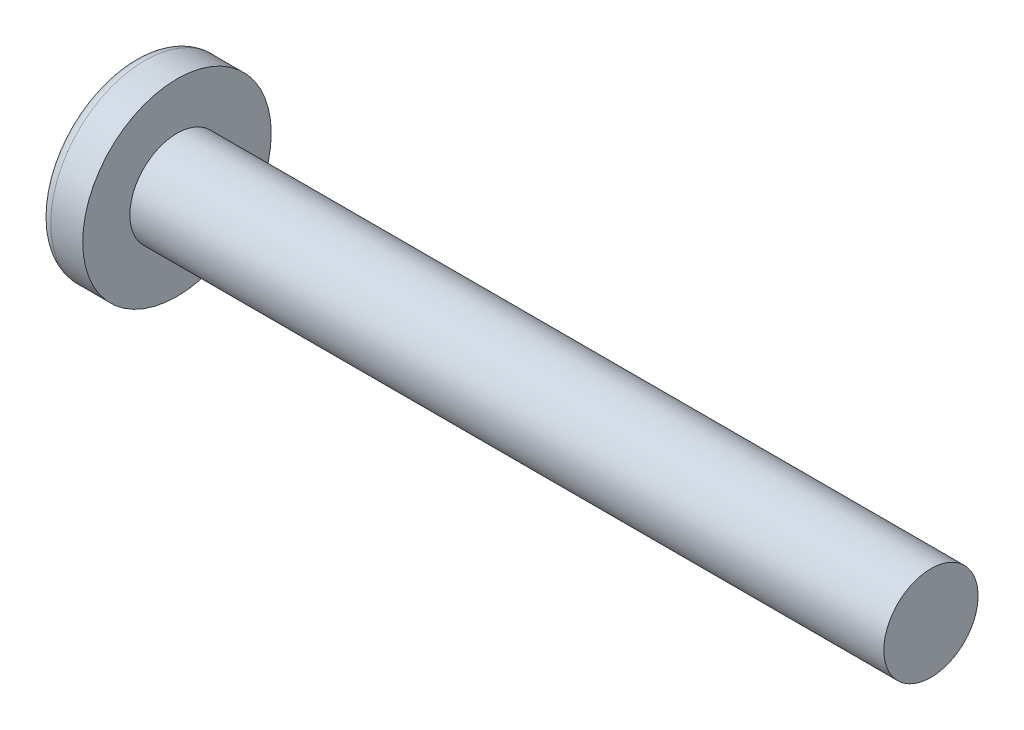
from build123d import *

# Parameters (mm, degrees)
CIRPATTERN1_COUNT = 2
CIRPATTERN1_ANGLE = 90


with BuildPart() as part:
    # BodySke → Base-Revolve (revolve)
    with BuildSketch(Plane.XY, mode=Mode.PRIVATE) as base_revolve_sk:
        with BuildLine():
            Line((7.5, 5), (7.5, 10))
            Line((7.5, 10), (4.100420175, 10))
            ThreePointArc((4.100420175, 10), (3.560149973, 9.871498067), (3.135589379, 9.513513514))
            ThreePointArc((3.135589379, 9.513513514), (0.804103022, 5.008464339), (0, 0))
            Line((0, 0), (87.5, 0))
            Line((87.5, 0), (87.5, 5))
            Line((87.5, 5), (7.5, 5))
        make_face()
    revolve(base_revolve_sk.sketch.rotate(Axis((-25.4, 0, 0), (1, 0, 0)), 90), axis=Axis((-25.4, 0, 0), (1, 0, 0)))

    # Sketch3 → Cut-Loft1 section 0
    with BuildSketch(Plane(origin=(0, 0, 0), x_dir=(0, 0, -1), z_dir=(1, 0, 0))):
        with BuildLine():
            Line((0.92, -5.09), (-0.92, -5.09))
            Line((-0.92, -5.09), (-0.92, 5.09))
            Line((-0.92, 5.09), (0.92, 5.09))
            Line((0.92, 5.09), (0.92, -5.09))
        make_face()
    # Sketch4 → Cut-Loft1 section 1
    with BuildSketch(Plane(origin=(6.09, 0, 0), x_dir=(0, 0, -1), z_dir=(1, 0, 0))):
        with BuildLine():
            Line((0.46, -0.46), (-0.46, -0.46))
            Line((-0.46, -0.46), (-0.46, 0.46))
            Line((-0.46, 0.46), (0.46, 0.46))
            Line((0.46, 0.46), (0.46, -0.46))
        make_face()
    cut_loft1 = loft(mode=Mode.SUBTRACT)

    # CirPattern1: Cut-Loft1 ×2 about axis
    cirpattern1_axis = Axis((0, 0, 0), (1, 0, 0))
    for i in range(1, CIRPATTERN1_COUNT):
        add(cut_loft1.rotate(cirpattern1_axis, i * CIRPATTERN1_ANGLE / (CIRPATTERN1_COUNT - 1)), mode=Mode.SUBTRACT)


solid = part.part
